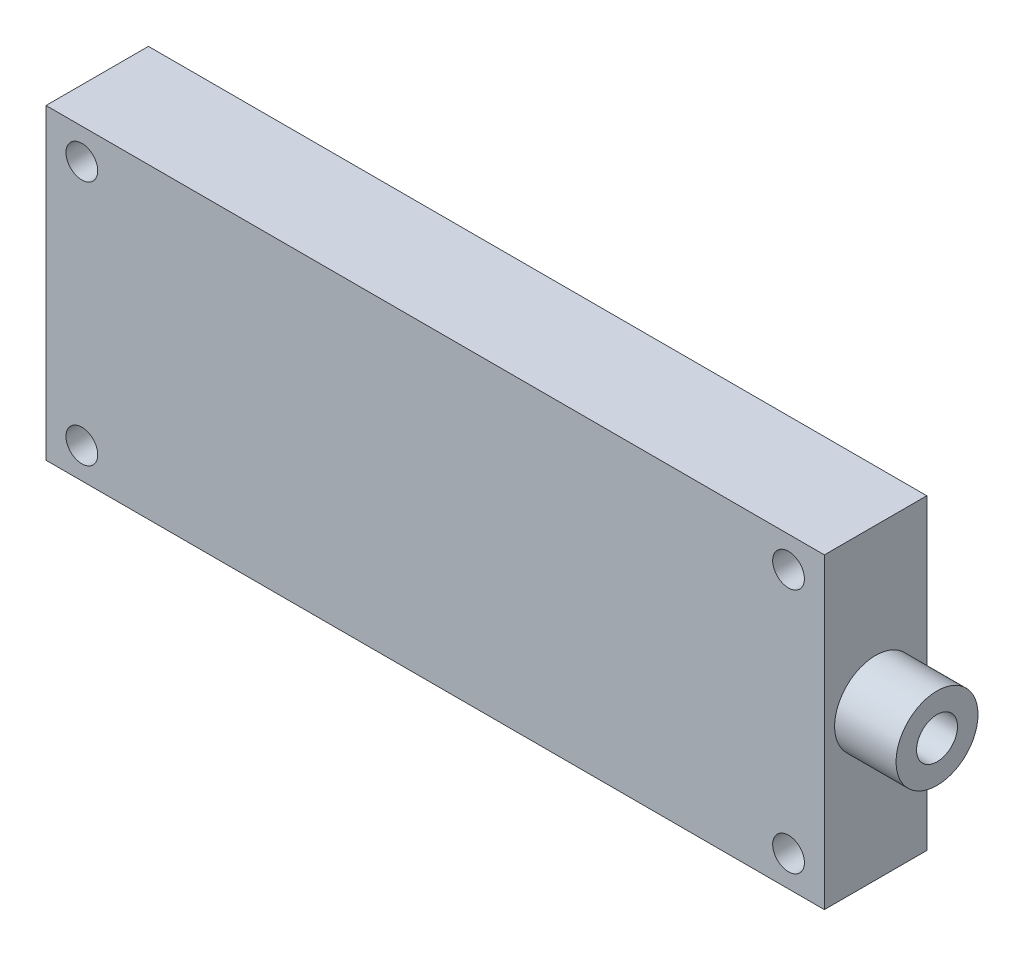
ISO-10303-21;
HEADER;
FILE_DESCRIPTION(('STEP AP214'),'2;1');
FILE_NAME('part.step','',(''),(''),'','','');
FILE_SCHEMA(('AUTOMOTIVE_DESIGN { 1 0 10303 214 1 1 1 1 }'));
ENDSEC;
DATA;
#1=APPLICATION_CONTEXT('core data for automotive mechanical design processes');
#2=APPLICATION_PROTOCOL_DEFINITION('international standard','automotive_design',2000,#1);
#3=PRODUCT_CONTEXT('',#1,'mechanical');
#4=PRODUCT('Part','Part','',(#3));
#5=PRODUCT_RELATED_PRODUCT_CATEGORY('part','',(#4));
#6=PRODUCT_DEFINITION_FORMATION('','',#4);
#7=PRODUCT_DEFINITION_CONTEXT('part definition',#1,'design');
#8=PRODUCT_DEFINITION('design','',#6,#7);
#9=PRODUCT_DEFINITION_SHAPE('','',#8);
#10=(LENGTH_UNIT() NAMED_UNIT(*) SI_UNIT(.MILLI.,.METRE.));
#11=(NAMED_UNIT(*) PLANE_ANGLE_UNIT() SI_UNIT($,.RADIAN.));
#12=(NAMED_UNIT(*) SI_UNIT($,.STERADIAN.) SOLID_ANGLE_UNIT());
#13=UNCERTAINTY_MEASURE_WITH_UNIT(LENGTH_MEASURE(1.E-05),#10,'distance_accuracy_value','');
#14=(GEOMETRIC_REPRESENTATION_CONTEXT(3) GLOBAL_UNCERTAINTY_ASSIGNED_CONTEXT((#13)) GLOBAL_UNIT_ASSIGNED_CONTEXT((#10,
#11,#12)) REPRESENTATION_CONTEXT('',''));
#15=CARTESIAN_POINT('',(0.,0.,0.));
#16=DIRECTION('',(0.,0.,1.));
#17=DIRECTION('',(1.,0.,0.));
#18=AXIS2_PLACEMENT_3D('',#15,#16,#17);
#19=CARTESIAN_POINT('',(80.5,15.,5.));
#20=DIRECTION('',(1.,0.,0.));
#21=DIRECTION('',(0.,0.,-1.));
#22=AXIS2_PLACEMENT_3D('',#19,#20,#21);
#23=PLANE('',#22);
#24=CARTESIAN_POINT('',(80.5,15.,5.));
#25=DIRECTION('',(1.,0.,0.));
#26=DIRECTION('',(0.,0.,-1.));
#27=AXIS2_PLACEMENT_3D('',#24,#25,#26);
#28=CIRCLE('',#27,2.);
#29=CARTESIAN_POINT('',(80.5,16.5,3.67712434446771));
#30=VERTEX_POINT('',#29);
#31=CARTESIAN_POINT('',(80.5,16.5,6.32287565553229));
#32=VERTEX_POINT('',#31);
#33=EDGE_CURVE('E129',#30,#32,#28,.T.);
#34=ORIENTED_EDGE('',*,*,#33,.T.);
#35=DIRECTION('',(0.,0.,-1.));
#36=VECTOR('',#35,1.);
#37=CARTESIAN_POINT('',(80.5,16.5,0.));
#38=LINE('',#37,#36);
#39=EDGE_CURVE('E106',#32,#30,#38,.T.);
#40=ORIENTED_EDGE('',*,*,#39,.T.);
#41=EDGE_LOOP('',(#34,#40));
#42=FACE_BOUND('',#41,.T.);
#43=ADVANCED_FACE('F39',(#42),#23,.T.);
#44=CARTESIAN_POINT('',(0.,30.,10.));
#45=DIRECTION('',(1.,0.,0.));
#46=DIRECTION('',(0.,0.,-1.));
#47=AXIS2_PLACEMENT_3D('',#44,#45,#46);
#48=PLANE('',#47);
#49=DIRECTION('',(0.,-1.,0.));
#50=VECTOR('',#49,1.);
#51=CARTESIAN_POINT('',(0.,30.,0.));
#52=LINE('',#51,#50);
#53=CARTESIAN_POINT('',(0.,30.,0.));
#54=VERTEX_POINT('',#53);
#55=CARTESIAN_POINT('',(0.,0.,0.));
#56=VERTEX_POINT('',#55);
#57=EDGE_CURVE('E168',#54,#56,#52,.T.);
#58=ORIENTED_EDGE('',*,*,#57,.T.);
#59=DIRECTION('',(0.,0.,-1.));
#60=VECTOR('',#59,1.);
#61=CARTESIAN_POINT('',(0.,0.,10.));
#62=LINE('',#61,#60);
#63=CARTESIAN_POINT('',(0.,0.,10.));
#64=VERTEX_POINT('',#63);
#65=EDGE_CURVE('E43',#64,#56,#62,.T.);
#66=ORIENTED_EDGE('',*,*,#65,.F.);
#67=DIRECTION('',(0.,-1.,0.));
#68=VECTOR('',#67,1.);
#69=CARTESIAN_POINT('',(0.,30.,10.));
#70=LINE('',#69,#68);
#71=CARTESIAN_POINT('',(0.,30.,10.));
#72=VERTEX_POINT('',#71);
#73=EDGE_CURVE('E172',#72,#64,#70,.T.);
#74=ORIENTED_EDGE('',*,*,#73,.F.);
#75=DIRECTION('',(0.,0.,-1.));
#76=VECTOR('',#75,1.);
#77=CARTESIAN_POINT('',(0.,30.,10.));
#78=LINE('',#77,#76);
#79=EDGE_CURVE('E182',#72,#54,#78,.T.);
#80=ORIENTED_EDGE('',*,*,#79,.T.);
#81=EDGE_LOOP('',(#58,#66,#74,#80));
#82=FACE_BOUND('',#81,.T.);
#83=ADVANCED_FACE('F41',(#82),#48,.F.);
#84=CARTESIAN_POINT('',(0.,0.,10.));
#85=DIRECTION('',(0.,1.,0.));
#86=DIRECTION('',(0.,0.,1.));
#87=AXIS2_PLACEMENT_3D('',#84,#85,#86);
#88=PLANE('',#87);
#89=DIRECTION('',(1.,0.,0.));
#90=VECTOR('',#89,1.);
#91=CARTESIAN_POINT('',(0.,0.,0.));
#92=LINE('',#91,#90);
#93=CARTESIAN_POINT('',(76.,0.,0.));
#94=VERTEX_POINT('',#93);
#95=EDGE_CURVE('E186',#56,#94,#92,.T.);
#96=ORIENTED_EDGE('',*,*,#95,.T.);
#97=DIRECTION('',(0.,0.,-1.));
#98=VECTOR('',#97,1.);
#99=CARTESIAN_POINT('',(76.,0.,10.));
#100=LINE('',#99,#98);
#101=CARTESIAN_POINT('',(76.,0.,10.));
#102=VERTEX_POINT('',#101);
#103=EDGE_CURVE('E198',#102,#94,#100,.T.);
#104=ORIENTED_EDGE('',*,*,#103,.F.);
#105=DIRECTION('',(1.,0.,0.));
#106=VECTOR('',#105,1.);
#107=CARTESIAN_POINT('',(0.,0.,10.));
#108=LINE('',#107,#106);
#109=EDGE_CURVE('E94',#64,#102,#108,.T.);
#110=ORIENTED_EDGE('',*,*,#109,.F.);
#111=ORIENTED_EDGE('',*,*,#65,.T.);
#112=EDGE_LOOP('',(#96,#104,#110,#111));
#113=FACE_BOUND('',#112,.T.);
#114=ADVANCED_FACE('F206',(#113),#88,.F.);
#115=CARTESIAN_POINT('',(76.,30.,10.));
#116=DIRECTION('',(-1.,0.,0.));
#117=DIRECTION('',(0.,0.,1.));
#118=AXIS2_PLACEMENT_3D('',#115,#116,#117);
#119=PLANE('',#118);
#120=CARTESIAN_POINT('',(76.,15.,5.));
#121=DIRECTION('',(1.,0.,0.));
#122=DIRECTION('',(0.,0.,-1.));
#123=AXIS2_PLACEMENT_3D('',#120,#121,#122);
#124=CIRCLE('',#123,4.);
#125=CARTESIAN_POINT('',(76.,15.,0.999999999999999));
#126=VERTEX_POINT('',#125);
#127=EDGE_CURVE('E11',#126,#126,#124,.T.);
#128=ORIENTED_EDGE('',*,*,#127,.F.);
#129=EDGE_LOOP('',(#128));
#130=FACE_BOUND('',#129,.T.);
#131=DIRECTION('',(0.,1.,0.));
#132=VECTOR('',#131,1.);
#133=CARTESIAN_POINT('',(76.,30.,0.));
#134=LINE('',#133,#132);
#135=CARTESIAN_POINT('',(76.,30.,0.));
#136=VERTEX_POINT('',#135);
#137=EDGE_CURVE('E189',#94,#136,#134,.T.);
#138=ORIENTED_EDGE('',*,*,#137,.T.);
#139=DIRECTION('',(0.,0.,-1.));
#140=VECTOR('',#139,1.);
#141=CARTESIAN_POINT('',(76.,30.,10.));
#142=LINE('',#141,#140);
#143=CARTESIAN_POINT('',(76.,30.,10.));
#144=VERTEX_POINT('',#143);
#145=EDGE_CURVE('E196',#144,#136,#142,.T.);
#146=ORIENTED_EDGE('',*,*,#145,.F.);
#147=DIRECTION('',(0.,1.,0.));
#148=VECTOR('',#147,1.);
#149=CARTESIAN_POINT('',(76.,30.,10.));
#150=LINE('',#149,#148);
#151=EDGE_CURVE('E177',#102,#144,#150,.T.);
#152=ORIENTED_EDGE('',*,*,#151,.F.);
#153=ORIENTED_EDGE('',*,*,#103,.T.);
#154=EDGE_LOOP('',(#138,#146,#152,#153));
#155=FACE_BOUND('',#154,.T.);
#156=ADVANCED_FACE('F213',(#130,#155),#119,.F.);
#157=CARTESIAN_POINT('',(0.,30.,10.));
#158=DIRECTION('',(0.,-1.,0.));
#159=DIRECTION('',(0.,0.,-1.));
#160=AXIS2_PLACEMENT_3D('',#157,#158,#159);
#161=PLANE('',#160);
#162=DIRECTION('',(-1.,0.,0.));
#163=VECTOR('',#162,1.);
#164=CARTESIAN_POINT('',(0.,30.,0.));
#165=LINE('',#164,#163);
#166=EDGE_CURVE('E86',#136,#54,#165,.T.);
#167=ORIENTED_EDGE('',*,*,#166,.T.);
#168=ORIENTED_EDGE('',*,*,#79,.F.);
#169=DIRECTION('',(-1.,0.,0.));
#170=VECTOR('',#169,1.);
#171=CARTESIAN_POINT('',(0.,30.,10.));
#172=LINE('',#171,#170);
#173=EDGE_CURVE('E65',#144,#72,#172,.T.);
#174=ORIENTED_EDGE('',*,*,#173,.F.);
#175=ORIENTED_EDGE('',*,*,#145,.T.);
#176=EDGE_LOOP('',(#167,#168,#174,#175));
#177=FACE_BOUND('',#176,.T.);
#178=ADVANCED_FACE('F214',(#177),#161,.F.);
#179=CARTESIAN_POINT('',(0.,0.,10.));
#180=DIRECTION('',(0.,0.,1.));
#181=DIRECTION('',(1.,0.,0.));
#182=AXIS2_PLACEMENT_3D('',#179,#180,#181);
#183=PLANE('',#182);
#184=CARTESIAN_POINT('',(72.5,27.,10.));
#185=DIRECTION('',(0.,0.,1.));
#186=DIRECTION('',(1.,0.,0.));
#187=AXIS2_PLACEMENT_3D('',#184,#185,#186);
#188=CIRCLE('',#187,1.54999999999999);
#189=CARTESIAN_POINT('',(74.05,27.,10.));
#190=VERTEX_POINT('',#189);
#191=EDGE_CURVE('E138',#190,#190,#188,.T.);
#192=ORIENTED_EDGE('',*,*,#191,.F.);
#193=EDGE_LOOP('',(#192));
#194=FACE_BOUND('',#193,.T.);
#195=CARTESIAN_POINT('',(72.5,3.,10.));
#196=DIRECTION('',(0.,0.,1.));
#197=DIRECTION('',(1.,0.,0.));
#198=AXIS2_PLACEMENT_3D('',#195,#196,#197);
#199=CIRCLE('',#198,1.54999999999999);
#200=CARTESIAN_POINT('',(74.05,3.,10.));
#201=VERTEX_POINT('',#200);
#202=EDGE_CURVE('E153',#201,#201,#199,.T.);
#203=ORIENTED_EDGE('',*,*,#202,.F.);
#204=EDGE_LOOP('',(#203));
#205=FACE_BOUND('',#204,.T.);
#206=CARTESIAN_POINT('',(3.5,3.,10.));
#207=DIRECTION('',(0.,0.,1.));
#208=DIRECTION('',(1.,0.,0.));
#209=AXIS2_PLACEMENT_3D('',#206,#207,#208);
#210=CIRCLE('',#209,1.55);
#211=CARTESIAN_POINT('',(5.05,3.,10.));
#212=VERTEX_POINT('',#211);
#213=EDGE_CURVE('E145',#212,#212,#210,.T.);
#214=ORIENTED_EDGE('',*,*,#213,.F.);
#215=EDGE_LOOP('',(#214));
#216=FACE_BOUND('',#215,.T.);
#217=CARTESIAN_POINT('',(3.5,27.,10.));
#218=DIRECTION('',(0.,0.,1.));
#219=DIRECTION('',(1.,0.,0.));
#220=AXIS2_PLACEMENT_3D('',#217,#218,#219);
#221=CIRCLE('',#220,1.55);
#222=CARTESIAN_POINT('',(5.05,27.,10.));
#223=VERTEX_POINT('',#222);
#224=EDGE_CURVE('E144',#223,#223,#221,.T.);
#225=ORIENTED_EDGE('',*,*,#224,.F.);
#226=EDGE_LOOP('',(#225));
#227=FACE_BOUND('',#226,.T.);
#228=ORIENTED_EDGE('',*,*,#73,.T.);
#229=ORIENTED_EDGE('',*,*,#109,.T.);
#230=ORIENTED_EDGE('',*,*,#151,.T.);
#231=ORIENTED_EDGE('',*,*,#173,.T.);
#232=EDGE_LOOP('',(#228,#229,#230,#231));
#233=FACE_BOUND('',#232,.T.);
#234=ADVANCED_FACE('F215',(#194,#205,#216,#227,#233),#183,.T.);
#235=CARTESIAN_POINT('',(0.,0.,0.));
#236=DIRECTION('',(0.,0.,1.));
#237=DIRECTION('',(1.,0.,0.));
#238=AXIS2_PLACEMENT_3D('',#235,#236,#237);
#239=PLANE('',#238);
#240=ORIENTED_EDGE('',*,*,#57,.F.);
#241=ORIENTED_EDGE('',*,*,#166,.F.);
#242=ORIENTED_EDGE('',*,*,#137,.F.);
#243=ORIENTED_EDGE('',*,*,#95,.F.);
#244=EDGE_LOOP('',(#240,#241,#242,#243));
#245=FACE_BOUND('',#244,.T.);
#246=ADVANCED_FACE('F211',(#245),#239,.F.);
#247=CARTESIAN_POINT('',(3.5,27.,7.));
#248=DIRECTION('',(0.,0.,1.));
#249=DIRECTION('',(1.,0.,0.));
#250=AXIS2_PLACEMENT_3D('',#247,#248,#249);
#251=CYLINDRICAL_SURFACE('',#250,1.55);
#252=CARTESIAN_POINT('',(3.5,27.,7.));
#253=DIRECTION('',(0.,0.,1.));
#254=DIRECTION('',(1.,0.,0.));
#255=AXIS2_PLACEMENT_3D('',#252,#253,#254);
#256=CIRCLE('',#255,1.55);
#257=CARTESIAN_POINT('',(5.05,27.,7.));
#258=VERTEX_POINT('',#257);
#259=EDGE_CURVE('E164',#258,#258,#256,.T.);
#260=ORIENTED_EDGE('',*,*,#259,.F.);
#261=EDGE_LOOP('',(#260));
#262=FACE_BOUND('',#261,.T.);
#263=ORIENTED_EDGE('',*,*,#224,.T.);
#264=EDGE_LOOP('',(#263));
#265=FACE_BOUND('',#264,.T.);
#266=ADVANCED_FACE('F223',(#262,#265),#251,.F.);
#267=CARTESIAN_POINT('',(3.5,27.,7.));
#268=DIRECTION('',(0.,0.,1.));
#269=DIRECTION('',(1.,0.,0.));
#270=AXIS2_PLACEMENT_3D('',#267,#268,#269);
#271=PLANE('',#270);
#272=ORIENTED_EDGE('',*,*,#259,.T.);
#273=EDGE_LOOP('',(#272));
#274=FACE_BOUND('',#273,.T.);
#275=ADVANCED_FACE('F257',(#274),#271,.T.);
#276=CARTESIAN_POINT('',(3.5,3.,7.));
#277=DIRECTION('',(0.,0.,1.));
#278=DIRECTION('',(1.,0.,0.));
#279=AXIS2_PLACEMENT_3D('',#276,#277,#278);
#280=CYLINDRICAL_SURFACE('',#279,1.55);
#281=CARTESIAN_POINT('',(3.5,3.,7.));
#282=DIRECTION('',(0.,0.,1.));
#283=DIRECTION('',(1.,0.,0.));
#284=AXIS2_PLACEMENT_3D('',#281,#282,#283);
#285=CIRCLE('',#284,1.55);
#286=CARTESIAN_POINT('',(5.05,3.,7.));
#287=VERTEX_POINT('',#286);
#288=EDGE_CURVE('E140',#287,#287,#285,.T.);
#289=ORIENTED_EDGE('',*,*,#288,.F.);
#290=EDGE_LOOP('',(#289));
#291=FACE_BOUND('',#290,.T.);
#292=ORIENTED_EDGE('',*,*,#213,.T.);
#293=EDGE_LOOP('',(#292));
#294=FACE_BOUND('',#293,.T.);
#295=ADVANCED_FACE('F253',(#291,#294),#280,.F.);
#296=CARTESIAN_POINT('',(3.5,3.,7.));
#297=DIRECTION('',(0.,0.,1.));
#298=DIRECTION('',(1.,0.,0.));
#299=AXIS2_PLACEMENT_3D('',#296,#297,#298);
#300=PLANE('',#299);
#301=ORIENTED_EDGE('',*,*,#288,.T.);
#302=EDGE_LOOP('',(#301));
#303=FACE_BOUND('',#302,.T.);
#304=ADVANCED_FACE('F249',(#303),#300,.T.);
#305=CARTESIAN_POINT('',(72.5,3.,7.));
#306=DIRECTION('',(0.,0.,1.));
#307=DIRECTION('',(1.,0.,0.));
#308=AXIS2_PLACEMENT_3D('',#305,#306,#307);
#309=CYLINDRICAL_SURFACE('',#308,1.54999999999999);
#310=CARTESIAN_POINT('',(72.5,3.,7.));
#311=DIRECTION('',(0.,0.,1.));
#312=DIRECTION('',(1.,0.,0.));
#313=AXIS2_PLACEMENT_3D('',#310,#311,#312);
#314=CIRCLE('',#313,1.54999999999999);
#315=CARTESIAN_POINT('',(74.05,3.,7.));
#316=VERTEX_POINT('',#315);
#317=EDGE_CURVE('E149',#316,#316,#314,.T.);
#318=ORIENTED_EDGE('',*,*,#317,.F.);
#319=EDGE_LOOP('',(#318));
#320=FACE_BOUND('',#319,.T.);
#321=ORIENTED_EDGE('',*,*,#202,.T.);
#322=EDGE_LOOP('',(#321));
#323=FACE_BOUND('',#322,.T.);
#324=ADVANCED_FACE('F252',(#320,#323),#309,.F.);
#325=CARTESIAN_POINT('',(72.5,3.,7.));
#326=DIRECTION('',(0.,0.,1.));
#327=DIRECTION('',(1.,0.,0.));
#328=AXIS2_PLACEMENT_3D('',#325,#326,#327);
#329=PLANE('',#328);
#330=ORIENTED_EDGE('',*,*,#317,.T.);
#331=EDGE_LOOP('',(#330));
#332=FACE_BOUND('',#331,.T.);
#333=ADVANCED_FACE('F259',(#332),#329,.T.);
#334=CARTESIAN_POINT('',(72.5,27.,7.));
#335=DIRECTION('',(0.,0.,1.));
#336=DIRECTION('',(1.,0.,0.));
#337=AXIS2_PLACEMENT_3D('',#334,#335,#336);
#338=CYLINDRICAL_SURFACE('',#337,1.54999999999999);
#339=CARTESIAN_POINT('',(72.5,27.,7.));
#340=DIRECTION('',(0.,0.,1.));
#341=DIRECTION('',(1.,0.,0.));
#342=AXIS2_PLACEMENT_3D('',#339,#340,#341);
#343=CIRCLE('',#342,1.54999999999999);
#344=CARTESIAN_POINT('',(74.05,27.,7.));
#345=VERTEX_POINT('',#344);
#346=EDGE_CURVE('E157',#345,#345,#343,.T.);
#347=ORIENTED_EDGE('',*,*,#346,.F.);
#348=EDGE_LOOP('',(#347));
#349=FACE_BOUND('',#348,.T.);
#350=ORIENTED_EDGE('',*,*,#191,.T.);
#351=EDGE_LOOP('',(#350));
#352=FACE_BOUND('',#351,.T.);
#353=ADVANCED_FACE('F262',(#349,#352),#338,.F.);
#354=CARTESIAN_POINT('',(72.5,27.,7.));
#355=DIRECTION('',(0.,0.,1.));
#356=DIRECTION('',(1.,0.,0.));
#357=AXIS2_PLACEMENT_3D('',#354,#355,#356);
#358=PLANE('',#357);
#359=ORIENTED_EDGE('',*,*,#346,.T.);
#360=EDGE_LOOP('',(#359));
#361=FACE_BOUND('',#360,.T.);
#362=ADVANCED_FACE('F247',(#361),#358,.T.);
#363=CARTESIAN_POINT('',(82.,15.,5.));
#364=DIRECTION('',(-1.,0.,0.));
#365=DIRECTION('',(0.,0.,1.));
#366=AXIS2_PLACEMENT_3D('',#363,#364,#365);
#367=CYLINDRICAL_SURFACE('',#366,4.);
#368=CARTESIAN_POINT('',(82.,15.,5.));
#369=DIRECTION('',(1.,0.,0.));
#370=DIRECTION('',(0.,0.,-1.));
#371=AXIS2_PLACEMENT_3D('',#368,#369,#370);
#372=CIRCLE('',#371,4.);
#373=CARTESIAN_POINT('',(82.,15.,0.999999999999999));
#374=VERTEX_POINT('',#373);
#375=EDGE_CURVE('E132',#374,#374,#372,.T.);
#376=ORIENTED_EDGE('',*,*,#375,.F.);
#377=EDGE_LOOP('',(#376));
#378=FACE_BOUND('',#377,.T.);
#379=ORIENTED_EDGE('',*,*,#127,.T.);
#380=EDGE_LOOP('',(#379));
#381=FACE_BOUND('',#380,.T.);
#382=ADVANCED_FACE('F243',(#378,#381),#367,.T.);
#383=CARTESIAN_POINT('',(82.,15.,5.));
#384=DIRECTION('',(1.,0.,0.));
#385=DIRECTION('',(0.,0.,-1.));
#386=AXIS2_PLACEMENT_3D('',#383,#384,#385);
#387=PLANE('',#386);
#388=CARTESIAN_POINT('',(82.,15.,5.));
#389=DIRECTION('',(1.,0.,0.));
#390=DIRECTION('',(0.,0.,-1.));
#391=AXIS2_PLACEMENT_3D('',#388,#389,#390);
#392=CIRCLE('',#391,2.);
#393=CARTESIAN_POINT('',(82.,15.,3.));
#394=VERTEX_POINT('',#393);
#395=EDGE_CURVE('E127',#394,#394,#392,.T.);
#396=ORIENTED_EDGE('',*,*,#395,.F.);
#397=EDGE_LOOP('',(#396));
#398=FACE_BOUND('',#397,.T.);
#399=ORIENTED_EDGE('',*,*,#375,.T.);
#400=EDGE_LOOP('',(#399));
#401=FACE_BOUND('',#400,.T.);
#402=ADVANCED_FACE('F240',(#398,#401),#387,.T.);
#403=CARTESIAN_POINT('',(80.5,15.,5.));
#404=DIRECTION('',(1.,0.,0.));
#405=DIRECTION('',(0.,0.,-1.));
#406=AXIS2_PLACEMENT_3D('',#403,#404,#405);
#407=CYLINDRICAL_SURFACE('',#406,2.);
#408=ORIENTED_EDGE('',*,*,#33,.F.);
#409=DIRECTION('',(1.,0.,0.));
#410=VECTOR('',#409,1.);
#411=CARTESIAN_POINT('',(73.5,16.5,3.67712434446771));
#412=LINE('',#411,#410);
#413=CARTESIAN_POINT('',(73.5,16.5,3.67712434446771));
#414=VERTEX_POINT('',#413);
#415=EDGE_CURVE('E56',#414,#30,#412,.T.);
#416=ORIENTED_EDGE('',*,*,#415,.F.);
#417=CARTESIAN_POINT('',(73.5,15.,5.));
#418=DIRECTION('',(1.,0.,0.));
#419=DIRECTION('',(0.,0.,-1.));
#420=AXIS2_PLACEMENT_3D('',#417,#418,#419);
#421=CIRCLE('',#420,2.);
#422=CARTESIAN_POINT('',(73.5,16.5,6.32287565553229));
#423=VERTEX_POINT('',#422);
#424=EDGE_CURVE('E112',#423,#414,#421,.T.);
#425=ORIENTED_EDGE('',*,*,#424,.F.);
#426=DIRECTION('',(1.,0.,0.));
#427=VECTOR('',#426,1.);
#428=CARTESIAN_POINT('',(73.5,16.5,6.32287565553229));
#429=LINE('',#428,#427);
#430=EDGE_CURVE('E102',#423,#32,#429,.T.);
#431=ORIENTED_EDGE('',*,*,#430,.T.);
#432=EDGE_LOOP('',(#408,#416,#425,#431));
#433=FACE_BOUND('',#432,.T.);
#434=ORIENTED_EDGE('',*,*,#395,.T.);
#435=EDGE_LOOP('',(#434));
#436=FACE_BOUND('',#435,.T.);
#437=ADVANCED_FACE('F119',(#433,#436),#407,.F.);
#438=CARTESIAN_POINT('',(73.5,16.5,0.));
#439=DIRECTION('',(0.,-1.,0.));
#440=DIRECTION('',(0.,0.,-1.));
#441=AXIS2_PLACEMENT_3D('',#438,#439,#440);
#442=PLANE('',#441);
#443=ORIENTED_EDGE('',*,*,#39,.F.);
#444=ORIENTED_EDGE('',*,*,#430,.F.);
#445=DIRECTION('',(0.,0.,-1.));
#446=VECTOR('',#445,1.);
#447=CARTESIAN_POINT('',(73.5,16.5,0.));
#448=LINE('',#447,#446);
#449=EDGE_CURVE('E105',#423,#414,#448,.T.);
#450=ORIENTED_EDGE('',*,*,#449,.T.);
#451=ORIENTED_EDGE('',*,*,#415,.T.);
#452=EDGE_LOOP('',(#443,#444,#450,#451));
#453=FACE_BOUND('',#452,.T.);
#454=ADVANCED_FACE('F104',(#453),#442,.T.);
#455=CARTESIAN_POINT('',(73.5,0.,0.));
#456=DIRECTION('',(1.,0.,0.));
#457=DIRECTION('',(0.,0.,-1.));
#458=AXIS2_PLACEMENT_3D('',#455,#456,#457);
#459=PLANE('',#458);
#460=ORIENTED_EDGE('',*,*,#449,.F.);
#461=ORIENTED_EDGE('',*,*,#424,.T.);
#462=EDGE_LOOP('',(#460,#461));
#463=FACE_BOUND('',#462,.T.);
#464=ADVANCED_FACE('F116',(#463),#459,.T.);
#465=CLOSED_SHELL('',(#43,#83,#114,#156,#178,#234,#246,#266,#275,#295,#304,#324,#333,#353,#362,
#382,#402,#437,#454,#464));
#466=MANIFOLD_SOLID_BREP('B2',#465);
#467=ADVANCED_BREP_SHAPE_REPRESENTATION('',(#18,#466),#14);
#468=SHAPE_DEFINITION_REPRESENTATION(#9,#467);
ENDSEC;
END-ISO-10303-21;
